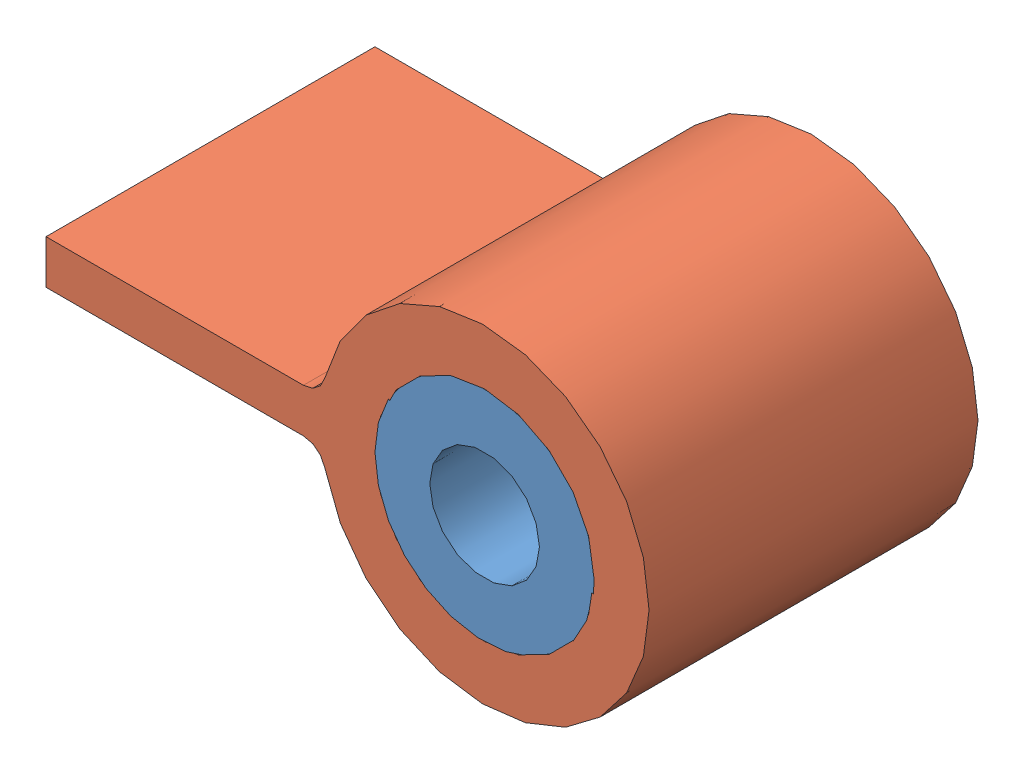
SolidWorks assembly SHRINK FIT.SLDASM, configuration Default (file format 4400). Lengths in mm.
Overall size (55 30 30).
2 component instances, 2 part files, 3 mates.
Components (placement in the parent):
- shrink fit 02-1: shrink fit 02.SLDPRT [Default] at origin size (20 20 30)
- shrink fit 01-1: shrink fit 01.SLDPRT [Default] at origin size (55 30 30)
Mates (geometry in assembly coordinates):
- Concentric1: concentric aligned: cylinder of shrink fit 02-1 through (0 0 0) axis (0 0 1) radius 5; cylinder of shrink fit 01-1 through (0 0 0) axis (0 0 1) radius 9.975
- Coincident1: coincident aligned: plane of shrink fit 02-1 through (0 0 30) normal (0 0 1); plane of shrink fit 01-1 through (0 0 30) normal (0 0 1)
- Coincident3: coincident aligned: plane of ? through (0 0 0) normal (0 1 0); plane of ? through (0 0 0) normal (0 1 0); cylinder of ? through (0 0 30) axis (0 0 -1) radius 10
